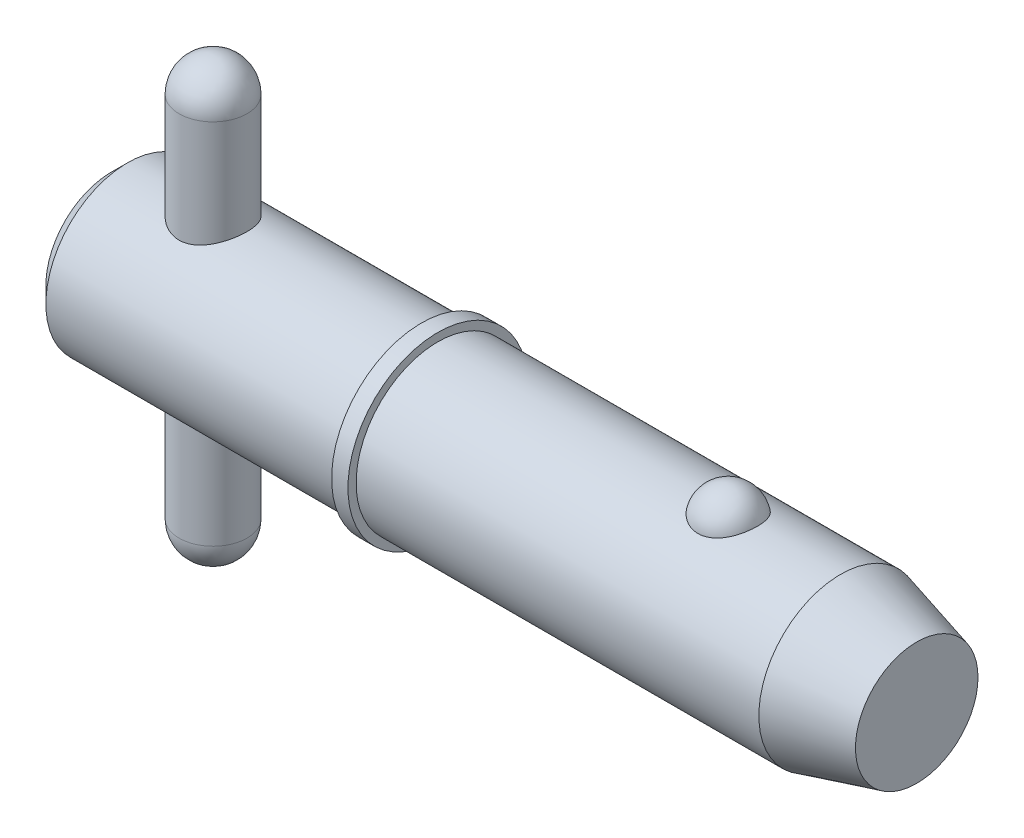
ISO-10303-21;
HEADER;
FILE_DESCRIPTION(('STEP AP214'),'2;1');
FILE_NAME('part.step','',(''),(''),'','','');
FILE_SCHEMA(('AUTOMOTIVE_DESIGN { 1 0 10303 214 1 1 1 1 }'));
ENDSEC;
DATA;
#1=APPLICATION_CONTEXT('core data for automotive mechanical design processes');
#2=APPLICATION_PROTOCOL_DEFINITION('international standard','automotive_design',2000,#1);
#3=PRODUCT_CONTEXT('',#1,'mechanical');
#4=PRODUCT('Part','Part','',(#3));
#5=PRODUCT_RELATED_PRODUCT_CATEGORY('part','',(#4));
#6=PRODUCT_DEFINITION_FORMATION('','',#4);
#7=PRODUCT_DEFINITION_CONTEXT('part definition',#1,'design');
#8=PRODUCT_DEFINITION('design','',#6,#7);
#9=PRODUCT_DEFINITION_SHAPE('','',#8);
#10=(LENGTH_UNIT() NAMED_UNIT(*) SI_UNIT(.MILLI.,.METRE.));
#11=(NAMED_UNIT(*) PLANE_ANGLE_UNIT() SI_UNIT($,.RADIAN.));
#12=(NAMED_UNIT(*) SI_UNIT($,.STERADIAN.) SOLID_ANGLE_UNIT());
#13=UNCERTAINTY_MEASURE_WITH_UNIT(LENGTH_MEASURE(1.E-05),#10,'distance_accuracy_value','');
#14=(GEOMETRIC_REPRESENTATION_CONTEXT(3) GLOBAL_UNCERTAINTY_ASSIGNED_CONTEXT((#13)) GLOBAL_UNIT_ASSIGNED_CONTEXT((#10,
#11,#12)) REPRESENTATION_CONTEXT('',''));
#15=CARTESIAN_POINT('',(0.,0.,0.));
#16=DIRECTION('',(0.,0.,1.));
#17=DIRECTION('',(1.,0.,0.));
#18=AXIS2_PLACEMENT_3D('',#15,#16,#17);
#19=CARTESIAN_POINT('',(5.94,12.7,0.));
#20=DIRECTION('',(0.,-1.,0.));
#21=DIRECTION('',(0.,0.,-1.));
#22=AXIS2_PLACEMENT_3D('',#19,#20,#21);
#23=CYLINDRICAL_SURFACE('',#22,1.98);
#24=CARTESIAN_POINT('',(5.94,-10.72,0.));
#25=DIRECTION('',(0.,-1.,0.));
#26=DIRECTION('',(0.,0.,-1.));
#27=AXIS2_PLACEMENT_3D('',#24,#25,#26);
#28=CIRCLE('',#27,1.98);
#29=CARTESIAN_POINT('',(5.94,-10.72,-1.98));
#30=VERTEX_POINT('',#29);
#31=EDGE_CURVE('P0_E10',#30,#30,#28,.F.);
#32=ORIENTED_EDGE('',*,*,#31,.T.);
#33=EDGE_LOOP('',(#32));
#34=FACE_BOUND('',#33,.T.);
#35=CARTESIAN_POINT('',(5.94,10.72,0.));
#36=DIRECTION('',(0.,-1.,0.));
#37=DIRECTION('',(0.,0.,-1.));
#38=AXIS2_PLACEMENT_3D('',#35,#36,#37);
#39=CIRCLE('',#38,1.98);
#40=CARTESIAN_POINT('',(5.94,10.72,-1.98));
#41=VERTEX_POINT('',#40);
#42=EDGE_CURVE('P0_E21',#41,#41,#39,.T.);
#43=ORIENTED_EDGE('',*,*,#42,.T.);
#44=EDGE_LOOP('',(#43));
#45=FACE_BOUND('',#44,.T.);
#46=ADVANCED_FACE('P0_F14',(#34,#45),#23,.T.);
#47=CARTESIAN_POINT('',(5.94,-10.72,0.));
#48=DIRECTION('',(0.,0.,1.));
#49=DIRECTION('',(1.,0.,0.));
#50=AXIS2_PLACEMENT_3D('',#47,#48,#49);
#51=SPHERICAL_SURFACE('',#50,1.98);
#52=CARTESIAN_POINT('',(5.94,-10.72,0.));
#53=DIRECTION('',(0.,-1.,0.));
#54=DIRECTION('',(0.,0.,-1.));
#55=AXIS2_PLACEMENT_3D('',#52,#53,#54);
#56=SPHERICAL_SURFACE('',#55,1.98);
#57=ORIENTED_EDGE('',*,*,#31,.F.);
#58=EDGE_LOOP('',(#57));
#59=FACE_BOUND('',#58,.T.);
#60=ADVANCED_FACE('P0_F29',(#59),#56,.T.);
#61=CARTESIAN_POINT('',(5.94,10.72,0.));
#62=DIRECTION('',(0.,0.,1.));
#63=DIRECTION('',(1.,0.,0.));
#64=AXIS2_PLACEMENT_3D('',#61,#62,#63);
#65=SPHERICAL_SURFACE('',#64,1.98);
#66=CARTESIAN_POINT('',(5.94,10.72,0.));
#67=DIRECTION('',(0.,-1.,0.));
#68=DIRECTION('',(0.,0.,-1.));
#69=AXIS2_PLACEMENT_3D('',#66,#67,#68);
#70=SPHERICAL_SURFACE('',#69,1.98);
#71=ORIENTED_EDGE('',*,*,#42,.F.);
#72=EDGE_LOOP('',(#71));
#73=FACE_BOUND('',#72,.T.);
#74=ADVANCED_FACE('P0_F16',(#73),#70,.T.);
#75=CLOSED_SHELL('',(#46,#60,#74));
#76=MANIFOLD_SOLID_BREP('P0_B1',#75);
#77=CARTESIAN_POINT('',(0.,0.,0.));
#78=DIRECTION('',(1.,0.,0.));
#79=DIRECTION('',(0.,0.,-1.));
#80=AXIS2_PLACEMENT_3D('',#77,#78,#79);
#81=CYLINDRICAL_SURFACE('',#80,4.765);
#82=CARTESIAN_POINT('',(42.5441944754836,0.,0.));
#83=DIRECTION('',(1.,0.,0.));
#84=DIRECTION('',(0.,0.,-1.));
#85=AXIS2_PLACEMENT_3D('',#82,#83,#84);
#86=CIRCLE('',#85,4.765);
#87=CARTESIAN_POINT('',(42.5441944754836,0.,-4.765));
#88=VERTEX_POINT('',#87);
#89=EDGE_CURVE('P1_E81',#88,#88,#86,.T.);
#90=ORIENTED_EDGE('',*,*,#89,.F.);
#91=EDGE_LOOP('',(#90));
#92=FACE_BOUND('',#91,.T.);
#93=CARTESIAN_POINT('',(19.05,0.,0.));
#94=DIRECTION('',(1.,0.,0.));
#95=DIRECTION('',(0.,0.,-1.));
#96=AXIS2_PLACEMENT_3D('',#93,#94,#95);
#97=CIRCLE('',#96,4.765);
#98=CARTESIAN_POINT('',(19.05,0.,-4.765));
#99=VERTEX_POINT('',#98);
#100=EDGE_CURVE('P1_E85',#99,#99,#97,.T.);
#101=ORIENTED_EDGE('',*,*,#100,.T.);
#102=EDGE_LOOP('',(#101));
#103=FACE_BOUND('',#102,.T.);
#104=CARTESIAN_POINT('',(35.991020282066,4.42764777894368,1.76101111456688));
#105=CARTESIAN_POINT('',(35.8997212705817,4.42764470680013,1.76101422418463));
#106=CARTESIAN_POINT('',(35.8084468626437,4.43059091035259,1.75366340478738));
#107=CARTESIAN_POINT('',(35.6286154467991,4.44201846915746,1.72451180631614));
#108=CARTESIAN_POINT('',(35.5400577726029,4.45049845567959,1.70271460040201));
#109=CARTESIAN_POINT('',(35.3682570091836,4.47200516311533,1.64539370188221));
#110=CARTESIAN_POINT('',(35.2850064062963,4.48502527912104,1.60988994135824));
#111=CARTESIAN_POINT('',(35.1257633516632,4.51419542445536,1.52617873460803));
#112=CARTESIAN_POINT('',(35.0497723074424,4.53034605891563,1.47796883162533));
#113=CARTESIAN_POINT('',(34.9047445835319,4.5645931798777,1.36860494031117));
#114=CARTESIAN_POINT('',(34.8359645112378,4.58273170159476,1.3071242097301));
#115=CARTESIAN_POINT('',(34.7093423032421,4.61870302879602,1.17370204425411));
#116=CARTESIAN_POINT('',(34.6515021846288,4.63653577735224,1.10175868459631));
#117=CARTESIAN_POINT('',(34.5455709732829,4.67090140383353,0.945806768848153));
#118=CARTESIAN_POINT('',(34.4980305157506,4.68734068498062,0.861402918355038));
#119=CARTESIAN_POINT('',(34.4170817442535,4.71628466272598,0.685442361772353));
#120=CARTESIAN_POINT('',(34.3836747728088,4.72878898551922,0.593884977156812));
#121=CARTESIAN_POINT('',(34.331287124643,4.74874061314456,0.404781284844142));
#122=CARTESIAN_POINT('',(34.3125178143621,4.75611366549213,0.307168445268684));
#123=CARTESIAN_POINT('',(34.2905846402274,4.76475393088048,0.109940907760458));
#124=CARTESIAN_POINT('',(34.2874205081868,4.76602124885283,0.0103262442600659));
#125=CARTESIAN_POINT('',(34.2967405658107,4.76232928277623,-0.187629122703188));
#126=CARTESIAN_POINT('',(34.3091588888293,4.7573962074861,-0.285973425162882));
#127=CARTESIAN_POINT('',(34.3492804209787,4.74184975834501,-0.479027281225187));
#128=CARTESIAN_POINT('',(34.3769839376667,4.7312362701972,-0.573736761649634));
#129=CARTESIAN_POINT('',(34.4471581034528,4.70540026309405,-0.756973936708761));
#130=CARTESIAN_POINT('',(34.4896460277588,4.69017235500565,-0.845494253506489));
#131=CARTESIAN_POINT('',(34.588520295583,4.6566986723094,-1.01378033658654));
#132=CARTESIAN_POINT('',(34.6449076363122,4.63845268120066,-1.09354547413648));
#133=CARTESIAN_POINT('',(34.770552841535,4.60085438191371,-1.24228523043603));
#134=CARTESIAN_POINT('',(34.8398439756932,4.58149930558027,-1.31123108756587));
#135=CARTESIAN_POINT('',(34.9896066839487,4.54391653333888,-1.43607409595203));
#136=CARTESIAN_POINT('',(35.0700771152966,4.52568872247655,-1.49197257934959));
#137=CARTESIAN_POINT('',(35.2381500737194,4.49293007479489,-1.58786764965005));
#138=CARTESIAN_POINT('',(35.3255445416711,4.47832346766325,-1.62820219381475));
#139=CARTESIAN_POINT('',(35.506553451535,4.45406011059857,-1.69345757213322));
#140=CARTESIAN_POINT('',(35.6001655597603,4.44440151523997,-1.71838415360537));
#141=CARTESIAN_POINT('',(35.7858939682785,4.43159888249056,-1.75112843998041));
#142=CARTESIAN_POINT('',(35.877849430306,4.42815213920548,-1.75974223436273));
#143=CARTESIAN_POINT('',(36.0619658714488,4.427247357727,-1.76201865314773));
#144=CARTESIAN_POINT('',(36.1541268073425,4.42978816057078,-1.7556841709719));
#145=CARTESIAN_POINT('',(36.3331292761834,4.4403864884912,-1.72869560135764));
#146=CARTESIAN_POINT('',(36.4200474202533,4.44827555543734,-1.70847853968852));
#147=CARTESIAN_POINT('',(36.5891314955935,4.46852246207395,-1.65479562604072));
#148=CARTESIAN_POINT('',(36.6712970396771,4.48088066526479,-1.62132869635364));
#149=CARTESIAN_POINT('',(36.8305916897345,4.50907357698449,-1.54120560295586));
#150=CARTESIAN_POINT('',(36.9075700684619,4.52497884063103,-1.49427526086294));
#151=CARTESIAN_POINT('',(37.0527080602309,4.55845148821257,-1.38881222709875));
#152=CARTESIAN_POINT('',(37.1208656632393,4.57601924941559,-1.33027689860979));
#153=CARTESIAN_POINT('',(37.2500990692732,4.61196537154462,-1.19991049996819));
#154=CARTESIAN_POINT('',(37.3106562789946,4.63034074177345,-1.12756415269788));
#155=CARTESIAN_POINT('',(37.4192797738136,4.66513959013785,-0.973612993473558));
#156=CARTESIAN_POINT('',(37.4673438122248,4.68156271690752,-0.892006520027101));
#157=CARTESIAN_POINT('',(37.551383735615,4.71130224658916,-0.718892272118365));
#158=CARTESIAN_POINT('',(37.5869185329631,4.724501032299,-0.627149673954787));
#159=CARTESIAN_POINT('',(37.6429522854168,4.74571823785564,-0.438611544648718));
#160=CARTESIAN_POINT('',(37.663450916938,4.75373654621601,-0.341815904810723));
#161=CARTESIAN_POINT('',(37.6890338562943,4.76378905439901,-0.145633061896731));
#162=CARTESIAN_POINT('',(37.694076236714,4.76580697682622,-0.0462395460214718));
#163=CARTESIAN_POINT('',(37.6885239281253,4.76360573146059,0.15203857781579));
#164=CARTESIAN_POINT('',(37.6779294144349,4.75938663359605,0.250923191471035));
#165=CARTESIAN_POINT('',(37.6413875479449,4.74516937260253,0.445004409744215));
#166=CARTESIAN_POINT('',(37.6154964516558,4.73519238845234,0.54021317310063));
#167=CARTESIAN_POINT('',(37.5489273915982,4.7104939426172,0.724662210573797));
#168=CARTESIAN_POINT('',(37.508248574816,4.69577220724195,0.813902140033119));
#169=CARTESIAN_POINT('',(37.4127177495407,4.66303767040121,0.984313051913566));
#170=CARTESIAN_POINT('',(37.3578042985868,4.64501070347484,1.06544688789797));
#171=CARTESIAN_POINT('',(37.2350496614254,4.60764678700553,1.21692673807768));
#172=CARTESIAN_POINT('',(37.1672086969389,4.58830985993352,1.2872729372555));
#173=CARTESIAN_POINT('',(37.0205480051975,4.55060370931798,1.41479271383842));
#174=CARTESIAN_POINT('',(36.9417918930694,4.53222967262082,1.47203785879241));
#175=CARTESIAN_POINT('',(36.7749890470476,4.49849576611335,1.57212016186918));
#176=CARTESIAN_POINT('',(36.6869417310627,4.48313608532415,1.61495641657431));
#177=CARTESIAN_POINT('',(36.4997918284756,4.45676184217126,1.68642657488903));
#178=CARTESIAN_POINT('',(36.4003653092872,4.44598302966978,1.71430590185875));
#179=CARTESIAN_POINT('',(36.1976210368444,4.43142918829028,1.7515925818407));
#180=CARTESIAN_POINT('',(36.0943049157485,4.42765125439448,1.76100759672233));
#181=CARTESIAN_POINT('',(35.991020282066,4.42764777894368,1.76101111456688));
#182=B_SPLINE_CURVE_WITH_KNOTS('',3,(#104,#105,#106,#107,#108,#109,#110,#111,#112,#113,#114,
#115,#116,#117,#118,#119,#120,#121,#122,#123,#124,#125,#126,#127,#128,#129,#130,#131,#132,#133,
#134,#135,#136,#137,#138,#139,#140,#141,#142,#143,#144,#145,#146,#147,#148,#149,#150,#151,#152,
#153,#154,#155,#156,#157,#158,#159,#160,#161,#162,#163,#164,#165,#166,#167,#168,#169,#170,#171,
#172,#173,#174,#175,#176,#177,#178,#179,#180,#181),.UNSPECIFIED.,.T.,.F.,(4,2,2,2,2,2,2,2,2,2,2,
2,2,2,2,2,2,2,2,2,2,2,2,2,2,2,2,2,2,2,2,2,2,2,2,2,2,2,4),(0.,0.273517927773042,
0.546968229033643,0.820022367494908,1.09312934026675,1.37393946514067,1.65480131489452,
1.94820420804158,2.24163496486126,2.53922817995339,2.8368162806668,3.13315071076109,
3.42949110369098,3.72617893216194,4.02288805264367,4.32037303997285,4.61782764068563,
4.90840095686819,5.19886582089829,5.4747485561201,5.75057789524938,6.01809977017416,
6.28564340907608,6.55907787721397,6.83257454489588,7.11962987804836,7.40673679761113,
7.70312663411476,7.99952284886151,8.29672237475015,8.59391856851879,8.89002850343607,
9.18615552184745,9.483582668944,9.78100471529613,10.0767610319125,10.3725358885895,
10.6820893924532,10.991514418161),.UNSPECIFIED.);
#183=CARTESIAN_POINT('',(35.991020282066,4.42764777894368,1.76101111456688));
#184=VERTEX_POINT('',#183);
#185=EDGE_CURVE('P1_E35',#184,#184,#182,.T.);
#186=ORIENTED_EDGE('',*,*,#185,.T.);
#187=EDGE_LOOP('',(#186));
#188=FACE_BOUND('',#187,.T.);
#189=ADVANCED_FACE('P1_F13',(#92,#103,#188),#81,.T.);
#190=CARTESIAN_POINT('',(0.,0.,0.));
#191=DIRECTION('',(-1.,0.,0.));
#192=DIRECTION('',(0.,0.,1.));
#193=AXIS2_PLACEMENT_3D('',#190,#191,#192);
#194=PLANE('',#193);
#195=CARTESIAN_POINT('',(0.,0.,0.));
#196=DIRECTION('',(1.,0.,0.));
#197=DIRECTION('',(0.,0.,-1.));
#198=AXIS2_PLACEMENT_3D('',#195,#196,#197);
#199=CIRCLE('',#198,3.812);
#200=CARTESIAN_POINT('',(0.,0.,-3.812));
#201=VERTEX_POINT('',#200);
#202=EDGE_CURVE('P1_E9',#201,#201,#199,.T.);
#203=ORIENTED_EDGE('',*,*,#202,.F.);
#204=EDGE_LOOP('',(#203));
#205=FACE_BOUND('',#204,.T.);
#206=ADVANCED_FACE('P1_F15',(#205),#194,.T.);
#207=CARTESIAN_POINT('',(0.952999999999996,0.,0.));
#208=DIRECTION('',(1.,0.,0.));
#209=DIRECTION('',(0.,0.,-1.));
#210=AXIS2_PLACEMENT_3D('',#207,#208,#209);
#211=CONICAL_SURFACE('',#210,4.765,0.78539816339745);
#212=ORIENTED_EDGE('',*,*,#202,.T.);
#213=EDGE_LOOP('',(#212));
#214=FACE_BOUND('',#213,.T.);
#215=CARTESIAN_POINT('',(0.952999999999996,0.,0.));
#216=DIRECTION('',(1.,0.,0.));
#217=DIRECTION('',(0.,0.,-1.));
#218=AXIS2_PLACEMENT_3D('',#215,#216,#217);
#219=CIRCLE('',#218,4.765);
#220=CARTESIAN_POINT('',(0.952999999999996,0.,-4.765));
#221=VERTEX_POINT('',#220);
#222=EDGE_CURVE('P1_E26',#221,#221,#219,.T.);
#223=ORIENTED_EDGE('',*,*,#222,.F.);
#224=EDGE_LOOP('',(#223));
#225=FACE_BOUND('',#224,.T.);
#226=ADVANCED_FACE('P1_F77',(#214,#225),#211,.T.);
#227=CARTESIAN_POINT('',(0.,0.,0.));
#228=DIRECTION('',(1.,0.,0.));
#229=DIRECTION('',(0.,0.,-1.));
#230=AXIS2_PLACEMENT_3D('',#227,#228,#229);
#231=CYLINDRICAL_SURFACE('',#230,4.765);
#232=CARTESIAN_POINT('',(5.94,-4.33414639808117,1.98));
#233=CARTESIAN_POINT('',(5.83435484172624,-4.33415447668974,1.97999169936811));
#234=CARTESIAN_POINT('',(5.72854887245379,-4.33806396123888,1.97149330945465));
#235=CARTESIAN_POINT('',(5.51998191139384,-4.35319906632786,1.93783487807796));
#236=CARTESIAN_POINT('',(5.41723000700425,-4.3644446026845,1.91262947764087));
#237=CARTESIAN_POINT('',(5.21817294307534,-4.39274225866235,1.84670269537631));
#238=CARTESIAN_POINT('',(5.12184344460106,-4.40977076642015,1.80604432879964));
#239=CARTESIAN_POINT('',(4.93740039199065,-4.44768106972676,1.71055160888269));
#240=CARTESIAN_POINT('',(4.84928487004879,-4.46856193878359,1.65572066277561));
#241=CARTESIAN_POINT('',(4.67826533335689,-4.51326966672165,1.52981120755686));
#242=CARTESIAN_POINT('',(4.59593118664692,-4.53719608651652,1.45799365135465));
#243=CARTESIAN_POINT('',(4.44405452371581,-4.58448035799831,1.30170177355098));
#244=CARTESIAN_POINT('',(4.37451692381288,-4.60783798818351,1.21722260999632));
#245=CARTESIAN_POINT('',(4.24730683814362,-4.65256187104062,1.03353484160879));
#246=CARTESIAN_POINT('',(4.19027484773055,-4.67379892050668,0.933848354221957));
#247=CARTESIAN_POINT('',(4.0940363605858,-4.7106711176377,0.7252544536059));
#248=CARTESIAN_POINT('',(4.05482199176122,-4.72630873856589,0.61635113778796));
#249=CARTESIAN_POINT('',(3.99739515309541,-4.74951416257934,0.398397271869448));
#250=CARTESIAN_POINT('',(3.97820018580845,-4.7574579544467,0.289646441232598));
#251=CARTESIAN_POINT('',(3.95818309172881,-4.76574596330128,0.0701967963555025));
#252=CARTESIAN_POINT('',(3.95735355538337,-4.76609324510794,-0.0405012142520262));
#253=CARTESIAN_POINT('',(3.9735743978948,-4.75937098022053,-0.253561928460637));
#254=CARTESIAN_POINT('',(3.98954548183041,-4.75274912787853,-0.356023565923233));
#255=CARTESIAN_POINT('',(4.03706504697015,-4.73344665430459,-0.556659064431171));
#256=CARTESIAN_POINT('',(4.06861467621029,-4.72076558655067,-0.654832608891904));
#257=CARTESIAN_POINT('',(4.14677192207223,-4.69032846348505,-0.845904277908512));
#258=CARTESIAN_POINT('',(4.19360181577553,-4.67249797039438,-0.938699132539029));
#259=CARTESIAN_POINT('',(4.30077315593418,-4.63350852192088,-1.11535616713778));
#260=CARTESIAN_POINT('',(4.3611193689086,-4.61234839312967,-1.19921518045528));
#261=CARTESIAN_POINT('',(4.49853487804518,-4.56707259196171,-1.3618711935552));
#262=CARTESIAN_POINT('',(4.57648039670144,-4.5428537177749,-1.43990029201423));
#263=CARTESIAN_POINT('',(4.74440779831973,-4.49530722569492,-1.58211009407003));
#264=CARTESIAN_POINT('',(4.83439425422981,-4.47197995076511,-1.64628551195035));
#265=CARTESIAN_POINT('',(5.02755026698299,-4.42812342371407,-1.76092221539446));
#266=CARTESIAN_POINT('',(5.13105348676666,-4.40770990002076,-1.81086937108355));
#267=CARTESIAN_POINT('',(5.34607555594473,-4.37336901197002,-1.89231211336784));
#268=CARTESIAN_POINT('',(5.45758864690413,-4.3594370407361,-1.92382080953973));
#269=CARTESIAN_POINT('',(5.67777275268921,-4.34077746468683,-1.96554536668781));
#270=CARTESIAN_POINT('',(5.78616167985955,-4.33551319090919,-1.9770057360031));
#271=CARTESIAN_POINT('',(6.00341835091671,-4.33325118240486,-1.98196183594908));
#272=CARTESIAN_POINT('',(6.11228591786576,-4.33625061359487,-1.97546372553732));
#273=CARTESIAN_POINT('',(6.32012423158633,-4.34962383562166,-1.94582288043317));
#274=CARTESIAN_POINT('',(6.41928436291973,-4.35951709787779,-1.92376364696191));
#275=CARTESIAN_POINT('',(6.61241543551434,-4.38495043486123,-1.86506038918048));
#276=CARTESIAN_POINT('',(6.70638516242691,-4.40049182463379,-1.82841296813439));
#277=CARTESIAN_POINT('',(6.89090272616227,-4.43627016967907,-1.73985559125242));
#278=CARTESIAN_POINT('',(6.98113841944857,-4.45667771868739,-1.68736639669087));
#279=CARTESIAN_POINT('',(7.1519532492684,-4.49964530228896,-1.56919282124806));
#280=CARTESIAN_POINT('',(7.232528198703,-4.52220626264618,-1.50350275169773));
#281=CARTESIAN_POINT('',(7.38851617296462,-4.56914071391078,-1.35452895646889));
#282=CARTESIAN_POINT('',(7.46298462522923,-4.5935132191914,-1.27025197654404));
#283=CARTESIAN_POINT('',(7.59689029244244,-4.63962841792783,-1.08983181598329));
#284=CARTESIAN_POINT('',(7.65632644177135,-4.66137092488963,-0.993687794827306));
#285=CARTESIAN_POINT('',(7.75840361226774,-4.69991192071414,-0.791608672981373));
#286=CARTESIAN_POINT('',(7.80100481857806,-4.71669866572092,-0.685651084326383));
#287=CARTESIAN_POINT('',(7.86746997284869,-4.74331408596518,-0.467197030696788));
#288=CARTESIAN_POINT('',(7.8913450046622,-4.75314687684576,-0.354704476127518));
#289=CARTESIAN_POINT('',(7.91828971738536,-4.76427543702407,-0.134819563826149));
#290=CARTESIAN_POINT('',(7.92269147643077,-4.76611762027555,-0.027616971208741));
#291=CARTESIAN_POINT('',(7.91414154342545,-4.76256684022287,0.185959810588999));
#292=CARTESIAN_POINT('',(7.90119286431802,-4.75717513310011,0.292334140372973));
#293=CARTESIAN_POINT('',(7.85926572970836,-4.74004856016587,0.497383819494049));
#294=CARTESIAN_POINT('',(7.83086647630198,-4.72854322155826,0.596198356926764));
#295=CARTESIAN_POINT('',(7.75947503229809,-4.70045111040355,0.787624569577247));
#296=CARTESIAN_POINT('',(7.71648006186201,-4.68386336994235,0.880235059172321));
#297=CARTESIAN_POINT('',(7.6149456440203,-4.64628321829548,1.06122875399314));
#298=CARTESIAN_POINT('',(7.55579211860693,-4.62512577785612,1.14923242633));
#299=CARTESIAN_POINT('',(7.42451813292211,-4.58091700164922,1.31443888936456));
#300=CARTESIAN_POINT('',(7.35239289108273,-4.5578649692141,1.39163767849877));
#301=CARTESIAN_POINT('',(7.19146107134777,-4.51050832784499,1.53847013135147));
#302=CARTESIAN_POINT('',(7.10185635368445,-4.48622440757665,1.60723941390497));
#303=CARTESIAN_POINT('',(6.91164948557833,-4.44076541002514,1.72888900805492));
#304=CARTESIAN_POINT('',(6.81104124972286,-4.41959206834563,1.78176046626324));
#305=CARTESIAN_POINT('',(6.60181953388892,-4.38318936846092,1.86953227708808));
#306=CARTESIAN_POINT('',(6.49325511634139,-4.3679267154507,1.90453365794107));
#307=CARTESIAN_POINT('',(6.32681512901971,-4.35102038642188,1.94268459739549));
#308=CARTESIAN_POINT('',(6.27079191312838,-4.34638447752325,1.953006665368));
#309=CARTESIAN_POINT('',(6.15793999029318,-4.33925923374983,1.96879053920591));
#310=CARTESIAN_POINT('',(6.10111188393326,-4.33676837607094,1.97425579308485));
#311=CARTESIAN_POINT('',(6.00947316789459,-4.33456308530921,1.97908711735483));
#312=CARTESIAN_POINT('',(5.97474528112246,-4.33414374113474,1.98000272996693));
#313=CARTESIAN_POINT('',(5.94,-4.33414639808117,1.98));
#314=B_SPLINE_CURVE_WITH_KNOTS('',3,(#232,#233,#234,#235,#236,#237,#238,#239,#240,#241,#242,
#243,#244,#245,#246,#247,#248,#249,#250,#251,#252,#253,#254,#255,#256,#257,#258,#259,#260,#261,
#262,#263,#264,#265,#266,#267,#268,#269,#270,#271,#272,#273,#274,#275,#276,#277,#278,#279,#280,
#281,#282,#283,#284,#285,#286,#287,#288,#289,#290,#291,#292,#293,#294,#295,#296,#297,#298,#299,
#300,#301,#302,#303,#304,#305,#306,#307,#308,#309,#310,#311,#312,#313),.UNSPECIFIED.,.T.,.F.,(4,
2,2,2,2,2,2,2,2,2,2,2,2,2,2,2,2,2,2,2,2,2,2,2,2,2,2,2,2,2,2,2,2,2,2,2,2,2,2,2,4),(0.,
0.316814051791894,0.634491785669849,0.950887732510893,1.2672076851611,1.60127705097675,
1.93547449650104,2.28407463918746,2.63252061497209,2.96292077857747,3.29318763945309,
3.60346227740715,3.91375978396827,4.22878888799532,4.54392926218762,4.88117914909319,
5.21855748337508,5.56691259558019,5.91501972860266,6.24062939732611,6.56612741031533,
6.87094948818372,7.17584258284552,7.49361276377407,7.81152017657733,8.15513975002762,
8.4987836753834,8.8432355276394,9.18748334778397,9.50777781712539,9.8280166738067,
10.1370037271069,10.4460496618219,10.7690461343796,11.0921619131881,11.4371238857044,
11.7822776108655,12.1254577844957,12.2967183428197,12.4678572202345,12.5720531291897),.UNSPECIFIED.);
#315=CARTESIAN_POINT('',(5.94,-4.33414639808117,1.98));
#316=VERTEX_POINT('',#315);
#317=EDGE_CURVE('P1_E17',#316,#316,#314,.T.);
#318=ORIENTED_EDGE('',*,*,#317,.F.);
#319=EDGE_LOOP('',(#318));
#320=FACE_BOUND('',#319,.T.);
#321=CARTESIAN_POINT('',(5.94,4.33414639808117,1.98));
#322=CARTESIAN_POINT('',(6.04564515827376,4.33415447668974,1.97999169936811));
#323=CARTESIAN_POINT('',(6.15145112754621,4.33806396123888,1.97149330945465));
#324=CARTESIAN_POINT('',(6.36001808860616,4.35319906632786,1.93783487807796));
#325=CARTESIAN_POINT('',(6.46276999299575,4.3644446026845,1.91262947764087));
#326=CARTESIAN_POINT('',(6.66182705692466,4.39274225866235,1.84670269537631));
#327=CARTESIAN_POINT('',(6.75815655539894,4.40977076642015,1.80604432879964));
#328=CARTESIAN_POINT('',(6.94259960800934,4.44768106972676,1.71055160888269));
#329=CARTESIAN_POINT('',(7.03071512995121,4.46856193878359,1.65572066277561));
#330=CARTESIAN_POINT('',(7.20173466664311,4.51326966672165,1.52981120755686));
#331=CARTESIAN_POINT('',(7.28406881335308,4.53719608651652,1.45799365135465));
#332=CARTESIAN_POINT('',(7.43594547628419,4.58448035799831,1.30170177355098));
#333=CARTESIAN_POINT('',(7.50548307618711,4.60783798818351,1.21722260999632));
#334=CARTESIAN_POINT('',(7.63269316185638,4.65256187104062,1.03353484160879));
#335=CARTESIAN_POINT('',(7.68972515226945,4.67379892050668,0.933848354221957));
#336=CARTESIAN_POINT('',(7.7859636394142,4.7106711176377,0.7252544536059));
#337=CARTESIAN_POINT('',(7.82517800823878,4.72630873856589,0.61635113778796));
#338=CARTESIAN_POINT('',(7.88260484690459,4.74951416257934,0.398397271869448));
#339=CARTESIAN_POINT('',(7.90179981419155,4.7574579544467,0.289646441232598));
#340=CARTESIAN_POINT('',(7.92181690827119,4.76574596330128,0.0701967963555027));
#341=CARTESIAN_POINT('',(7.92264644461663,4.76609324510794,-0.040501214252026));
#342=CARTESIAN_POINT('',(7.9064256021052,4.75937098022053,-0.253561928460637));
#343=CARTESIAN_POINT('',(7.89045451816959,4.75274912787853,-0.356023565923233));
#344=CARTESIAN_POINT('',(7.84293495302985,4.73344665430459,-0.55665906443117));
#345=CARTESIAN_POINT('',(7.81138532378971,4.72076558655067,-0.654832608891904));
#346=CARTESIAN_POINT('',(7.73322807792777,4.69032846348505,-0.845904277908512));
#347=CARTESIAN_POINT('',(7.68639818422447,4.67249797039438,-0.938699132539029));
#348=CARTESIAN_POINT('',(7.57922684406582,4.63350852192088,-1.11535616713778));
#349=CARTESIAN_POINT('',(7.5188806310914,4.61234839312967,-1.19921518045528));
#350=CARTESIAN_POINT('',(7.38146512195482,4.56707259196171,-1.3618711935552));
#351=CARTESIAN_POINT('',(7.30351960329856,4.5428537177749,-1.43990029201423));
#352=CARTESIAN_POINT('',(7.13559220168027,4.49530722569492,-1.58211009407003));
#353=CARTESIAN_POINT('',(7.04560574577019,4.47197995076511,-1.64628551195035));
#354=CARTESIAN_POINT('',(6.85244973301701,4.42812342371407,-1.76092221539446));
#355=CARTESIAN_POINT('',(6.74894651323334,4.40770990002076,-1.81086937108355));
#356=CARTESIAN_POINT('',(6.53392444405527,4.37336901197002,-1.89231211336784));
#357=CARTESIAN_POINT('',(6.42241135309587,4.3594370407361,-1.92382080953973));
#358=CARTESIAN_POINT('',(6.20222724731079,4.34077746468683,-1.96554536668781));
#359=CARTESIAN_POINT('',(6.09383832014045,4.33551319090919,-1.9770057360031));
#360=CARTESIAN_POINT('',(5.87658164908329,4.33325118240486,-1.98196183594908));
#361=CARTESIAN_POINT('',(5.76771408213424,4.33625061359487,-1.97546372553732));
#362=CARTESIAN_POINT('',(5.55987576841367,4.34962383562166,-1.94582288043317));
#363=CARTESIAN_POINT('',(5.46071563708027,4.35951709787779,-1.92376364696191));
#364=CARTESIAN_POINT('',(5.26758456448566,4.38495043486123,-1.86506038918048));
#365=CARTESIAN_POINT('',(5.17361483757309,4.40049182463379,-1.82841296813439));
#366=CARTESIAN_POINT('',(4.98909727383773,4.43627016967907,-1.73985559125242));
#367=CARTESIAN_POINT('',(4.89886158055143,4.45667771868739,-1.68736639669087));
#368=CARTESIAN_POINT('',(4.72804675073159,4.49964530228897,-1.56919282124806));
#369=CARTESIAN_POINT('',(4.647471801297,4.52220626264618,-1.50350275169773));
#370=CARTESIAN_POINT('',(4.49148382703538,4.56914071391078,-1.35452895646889));
#371=CARTESIAN_POINT('',(4.41701537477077,4.5935132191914,-1.27025197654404));
#372=CARTESIAN_POINT('',(4.28310970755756,4.63962841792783,-1.08983181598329));
#373=CARTESIAN_POINT('',(4.22367355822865,4.66137092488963,-0.993687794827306));
#374=CARTESIAN_POINT('',(4.12159638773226,4.69991192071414,-0.791608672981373));
#375=CARTESIAN_POINT('',(4.07899518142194,4.71669866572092,-0.685651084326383));
#376=CARTESIAN_POINT('',(4.01253002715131,4.74331408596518,-0.467197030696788));
#377=CARTESIAN_POINT('',(3.98865499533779,4.75314687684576,-0.354704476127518));
#378=CARTESIAN_POINT('',(3.96171028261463,4.76427543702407,-0.134819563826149));
#379=CARTESIAN_POINT('',(3.95730852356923,4.76611762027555,-0.0276169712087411));
#380=CARTESIAN_POINT('',(3.96585845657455,4.76256684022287,0.185959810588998));
#381=CARTESIAN_POINT('',(3.97880713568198,4.75717513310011,0.292334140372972));
#382=CARTESIAN_POINT('',(4.02073427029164,4.74004856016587,0.497383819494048));
#383=CARTESIAN_POINT('',(4.04913352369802,4.72854322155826,0.596198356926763));
#384=CARTESIAN_POINT('',(4.12052496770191,4.70045111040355,0.787624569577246));
#385=CARTESIAN_POINT('',(4.16351993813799,4.68386336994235,0.880235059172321));
#386=CARTESIAN_POINT('',(4.2650543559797,4.64628321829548,1.06122875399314));
#387=CARTESIAN_POINT('',(4.32420788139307,4.62512577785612,1.14923242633));
#388=CARTESIAN_POINT('',(4.45548186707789,4.58091700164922,1.31443888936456));
#389=CARTESIAN_POINT('',(4.52760710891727,4.5578649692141,1.39163767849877));
#390=CARTESIAN_POINT('',(4.68853892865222,4.51050832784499,1.53847013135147));
#391=CARTESIAN_POINT('',(4.77814364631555,4.48622440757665,1.60723941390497));
#392=CARTESIAN_POINT('',(4.96835051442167,4.44076541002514,1.72888900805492));
#393=CARTESIAN_POINT('',(5.06895875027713,4.41959206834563,1.78176046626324));
#394=CARTESIAN_POINT('',(5.27818046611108,4.38318936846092,1.86953227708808));
#395=CARTESIAN_POINT('',(5.38674488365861,4.3679267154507,1.90453365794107));
#396=CARTESIAN_POINT('',(5.55318487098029,4.35102038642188,1.94268459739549));
#397=CARTESIAN_POINT('',(5.60920808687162,4.34638447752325,1.953006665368));
#398=CARTESIAN_POINT('',(5.72206000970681,4.33925923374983,1.96879053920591));
#399=CARTESIAN_POINT('',(5.77888811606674,4.33676837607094,1.97425579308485));
#400=CARTESIAN_POINT('',(5.87052683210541,4.33456308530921,1.97908711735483));
#401=CARTESIAN_POINT('',(5.90525471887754,4.33414374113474,1.98000272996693));
#402=CARTESIAN_POINT('',(5.94,4.33414639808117,1.98));
#403=B_SPLINE_CURVE_WITH_KNOTS('',3,(#321,#322,#323,#324,#325,#326,#327,#328,#329,#330,#331,
#332,#333,#334,#335,#336,#337,#338,#339,#340,#341,#342,#343,#344,#345,#346,#347,#348,#349,#350,
#351,#352,#353,#354,#355,#356,#357,#358,#359,#360,#361,#362,#363,#364,#365,#366,#367,#368,#369,
#370,#371,#372,#373,#374,#375,#376,#377,#378,#379,#380,#381,#382,#383,#384,#385,#386,#387,#388,
#389,#390,#391,#392,#393,#394,#395,#396,#397,#398,#399,#400,#401,#402),.UNSPECIFIED.,.T.,.F.,(4,
2,2,2,2,2,2,2,2,2,2,2,2,2,2,2,2,2,2,2,2,2,2,2,2,2,2,2,2,2,2,2,2,2,2,2,2,2,2,2,4),(0.,
0.316814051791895,0.634491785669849,0.950887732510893,1.2672076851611,1.60127705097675,
1.93547449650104,2.28407463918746,2.63252061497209,2.96292077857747,3.29318763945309,
3.60346227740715,3.91375978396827,4.22878888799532,4.54392926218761,4.88117914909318,
5.21855748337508,5.56691259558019,5.91501972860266,6.24062939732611,6.56612741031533,
6.87094948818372,7.17584258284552,7.49361276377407,7.81152017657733,8.15513975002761,
8.4987836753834,8.84323552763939,9.18748334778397,9.50777781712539,9.8280166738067,
10.1370037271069,10.4460496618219,10.7690461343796,11.0921619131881,11.4371238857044,
11.7822776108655,12.1254577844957,12.2967183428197,12.4678572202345,12.5720531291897),.UNSPECIFIED.);
#404=CARTESIAN_POINT('',(5.94,4.33414639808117,1.98));
#405=VERTEX_POINT('',#404);
#406=EDGE_CURVE('P1_E43',#405,#405,#403,.T.);
#407=ORIENTED_EDGE('',*,*,#406,.F.);
#408=EDGE_LOOP('',(#407));
#409=FACE_BOUND('',#408,.T.);
#410=ORIENTED_EDGE('',*,*,#222,.T.);
#411=EDGE_LOOP('',(#410));
#412=FACE_BOUND('',#411,.T.);
#413=CARTESIAN_POINT('',(18.097,0.,0.));
#414=DIRECTION('',(1.,0.,0.));
#415=DIRECTION('',(0.,0.,-1.));
#416=AXIS2_PLACEMENT_3D('',#413,#414,#415);
#417=CIRCLE('',#416,4.765);
#418=CARTESIAN_POINT('',(18.097,0.,-4.765));
#419=VERTEX_POINT('',#418);
#420=EDGE_CURVE('P1_E31',#419,#419,#417,.T.);
#421=ORIENTED_EDGE('',*,*,#420,.F.);
#422=EDGE_LOOP('',(#421));
#423=FACE_BOUND('',#422,.T.);
#424=ADVANCED_FACE('P1_F103',(#320,#409,#412,#423),#231,.T.);
#425=CARTESIAN_POINT('',(18.097,4.765,0.));
#426=DIRECTION('',(-1.,0.,0.));
#427=DIRECTION('',(0.,0.,1.));
#428=AXIS2_PLACEMENT_3D('',#425,#426,#427);
#429=PLANE('',#428);
#430=ORIENTED_EDGE('',*,*,#420,.T.);
#431=EDGE_LOOP('',(#430));
#432=FACE_BOUND('',#431,.T.);
#433=CARTESIAN_POINT('',(18.097,0.,0.));
#434=DIRECTION('',(1.,0.,0.));
#435=DIRECTION('',(0.,0.,-1.));
#436=AXIS2_PLACEMENT_3D('',#433,#434,#435);
#437=CIRCLE('',#436,5.2415);
#438=CARTESIAN_POINT('',(18.097,0.,-5.2415));
#439=VERTEX_POINT('',#438);
#440=EDGE_CURVE('P1_E91',#439,#439,#437,.T.);
#441=ORIENTED_EDGE('',*,*,#440,.F.);
#442=EDGE_LOOP('',(#441));
#443=FACE_BOUND('',#442,.T.);
#444=ADVANCED_FACE('P1_F100',(#432,#443),#429,.T.);
#445=CARTESIAN_POINT('',(0.,0.,0.));
#446=DIRECTION('',(1.,0.,0.));
#447=DIRECTION('',(0.,0.,-1.));
#448=AXIS2_PLACEMENT_3D('',#445,#446,#447);
#449=CYLINDRICAL_SURFACE('',#448,5.2415);
#450=ORIENTED_EDGE('',*,*,#440,.T.);
#451=EDGE_LOOP('',(#450));
#452=FACE_BOUND('',#451,.T.);
#453=CARTESIAN_POINT('',(19.05,0.,0.));
#454=DIRECTION('',(1.,0.,0.));
#455=DIRECTION('',(0.,0.,-1.));
#456=AXIS2_PLACEMENT_3D('',#453,#454,#455);
#457=CIRCLE('',#456,5.2415);
#458=CARTESIAN_POINT('',(19.05,0.,-5.2415));
#459=VERTEX_POINT('',#458);
#460=EDGE_CURVE('P1_E88',#459,#459,#457,.T.);
#461=ORIENTED_EDGE('',*,*,#460,.F.);
#462=EDGE_LOOP('',(#461));
#463=FACE_BOUND('',#462,.T.);
#464=ADVANCED_FACE('P1_F68',(#452,#463),#449,.T.);
#465=CARTESIAN_POINT('',(19.05,5.2415,0.));
#466=DIRECTION('',(1.,0.,0.));
#467=DIRECTION('',(0.,0.,-1.));
#468=AXIS2_PLACEMENT_3D('',#465,#466,#467);
#469=PLANE('',#468);
#470=ORIENTED_EDGE('',*,*,#460,.T.);
#471=EDGE_LOOP('',(#470));
#472=FACE_BOUND('',#471,.T.);
#473=ORIENTED_EDGE('',*,*,#100,.F.);
#474=EDGE_LOOP('',(#473));
#475=FACE_BOUND('',#474,.T.);
#476=ADVANCED_FACE('P1_F62',(#472,#475),#469,.T.);
#477=CARTESIAN_POINT('',(46.99,0.,0.));
#478=DIRECTION('',(-1.,0.,0.));
#479=DIRECTION('',(0.,0.,1.));
#480=AXIS2_PLACEMENT_3D('',#477,#478,#479);
#481=CONICAL_SURFACE('',#480,3.57375000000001,0.26179938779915);
#482=ORIENTED_EDGE('',*,*,#89,.T.);
#483=EDGE_LOOP('',(#482));
#484=FACE_BOUND('',#483,.T.);
#485=CARTESIAN_POINT('',(46.99,0.,0.));
#486=DIRECTION('',(1.,0.,0.));
#487=DIRECTION('',(0.,0.,-1.));
#488=AXIS2_PLACEMENT_3D('',#485,#486,#487);
#489=CIRCLE('',#488,3.57375000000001);
#490=CARTESIAN_POINT('',(46.99,0.,-3.57375000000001));
#491=VERTEX_POINT('',#490);
#492=EDGE_CURVE('P1_E42',#491,#491,#489,.T.);
#493=ORIENTED_EDGE('',*,*,#492,.F.);
#494=EDGE_LOOP('',(#493));
#495=FACE_BOUND('',#494,.T.);
#496=ADVANCED_FACE('P1_F59',(#484,#495),#481,.T.);
#497=CARTESIAN_POINT('',(46.99,3.57375000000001,0.));
#498=DIRECTION('',(1.,0.,0.));
#499=DIRECTION('',(0.,0.,-1.));
#500=AXIS2_PLACEMENT_3D('',#497,#498,#499);
#501=PLANE('',#500);
#502=ORIENTED_EDGE('',*,*,#492,.T.);
#503=EDGE_LOOP('',(#502));
#504=FACE_BOUND('',#503,.T.);
#505=ADVANCED_FACE('P1_F55',(#504),#501,.T.);
#506=CARTESIAN_POINT('',(35.991020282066,4.2885,0.));
#507=DIRECTION('',(-1.,0.,0.));
#508=DIRECTION('',(0.,1.,0.));
#509=AXIS2_PLACEMENT_3D('',#506,#507,#508);
#510=SPHERICAL_SURFACE('',#509,1.7665);
#511=ORIENTED_EDGE('',*,*,#185,.F.);
#512=EDGE_LOOP('',(#511));
#513=FACE_BOUND('',#512,.T.);
#514=ADVANCED_FACE('P1_F50',(#513),#510,.T.);
#515=CARTESIAN_POINT('',(5.94,-5.2415,0.));
#516=DIRECTION('',(0.,1.,0.));
#517=DIRECTION('',(0.,0.,1.));
#518=AXIS2_PLACEMENT_3D('',#515,#516,#517);
#519=CYLINDRICAL_SURFACE('',#518,1.98);
#520=ORIENTED_EDGE('',*,*,#317,.T.);
#521=EDGE_LOOP('',(#520));
#522=FACE_BOUND('',#521,.T.);
#523=ORIENTED_EDGE('',*,*,#406,.T.);
#524=EDGE_LOOP('',(#523));
#525=FACE_BOUND('',#524,.T.);
#526=ADVANCED_FACE('P1_F54',(#522,#525),#519,.F.);
#527=CLOSED_SHELL('',(#189,#206,#226,#424,#444,#464,#476,#496,#505,#514,#526));
#528=MANIFOLD_SOLID_BREP('P1_B1',#527);
#529=ADVANCED_BREP_SHAPE_REPRESENTATION('',(#18,#76,#528),#14);
#530=SHAPE_DEFINITION_REPRESENTATION(#9,#529);
ENDSEC;
END-ISO-10303-21;
